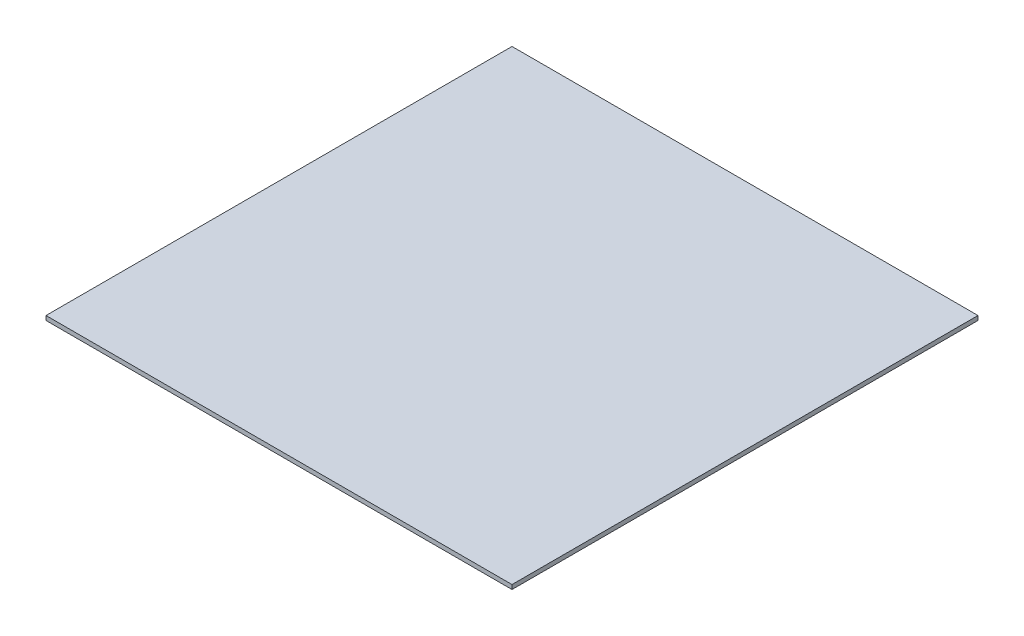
ISO-10303-21;
HEADER;
FILE_DESCRIPTION(('STEP AP214'),'2;1');
FILE_NAME('part.step','',(''),(''),'','','');
FILE_SCHEMA(('AUTOMOTIVE_DESIGN { 1 0 10303 214 1 1 1 1 }'));
ENDSEC;
DATA;
#1=APPLICATION_CONTEXT('core data for automotive mechanical design processes');
#2=APPLICATION_PROTOCOL_DEFINITION('international standard','automotive_design',2000,#1);
#3=PRODUCT_CONTEXT('',#1,'mechanical');
#4=PRODUCT('Part','Part','',(#3));
#5=PRODUCT_RELATED_PRODUCT_CATEGORY('part','',(#4));
#6=PRODUCT_DEFINITION_FORMATION('','',#4);
#7=PRODUCT_DEFINITION_CONTEXT('part definition',#1,'design');
#8=PRODUCT_DEFINITION('design','',#6,#7);
#9=PRODUCT_DEFINITION_SHAPE('','',#8);
#10=(LENGTH_UNIT() NAMED_UNIT(*) SI_UNIT(.MILLI.,.METRE.));
#11=(NAMED_UNIT(*) PLANE_ANGLE_UNIT() SI_UNIT($,.RADIAN.));
#12=(NAMED_UNIT(*) SI_UNIT($,.STERADIAN.) SOLID_ANGLE_UNIT());
#13=UNCERTAINTY_MEASURE_WITH_UNIT(LENGTH_MEASURE(1.E-05),#10,'distance_accuracy_value','');
#14=(GEOMETRIC_REPRESENTATION_CONTEXT(3) GLOBAL_UNCERTAINTY_ASSIGNED_CONTEXT((#13)) GLOBAL_UNIT_ASSIGNED_CONTEXT((#10,
#11,#12)) REPRESENTATION_CONTEXT('',''));
#15=CARTESIAN_POINT('',(0.,0.,0.));
#16=DIRECTION('',(0.,0.,1.));
#17=DIRECTION('',(1.,0.,0.));
#18=AXIS2_PLACEMENT_3D('',#15,#16,#17);
#19=CARTESIAN_POINT('',(215.,4.,-215.));
#20=DIRECTION('',(-1.,0.,0.));
#21=DIRECTION('',(0.,0.,1.));
#22=AXIS2_PLACEMENT_3D('',#19,#20,#21);
#23=PLANE('',#22);
#24=DIRECTION('',(0.,0.,-1.));
#25=VECTOR('',#24,1.);
#26=CARTESIAN_POINT('',(215.,0.,-215.));
#27=LINE('',#26,#25);
#28=CARTESIAN_POINT('',(215.,0.,215.));
#29=VERTEX_POINT('',#28);
#30=CARTESIAN_POINT('',(215.,0.,-215.));
#31=VERTEX_POINT('',#30);
#32=EDGE_CURVE('E96',#29,#31,#27,.T.);
#33=ORIENTED_EDGE('',*,*,#32,.T.);
#34=DIRECTION('',(0.,-1.,0.));
#35=VECTOR('',#34,1.);
#36=CARTESIAN_POINT('',(215.,4.,-215.));
#37=LINE('',#36,#35);
#38=CARTESIAN_POINT('',(215.,4.,-215.));
#39=VERTEX_POINT('',#38);
#40=EDGE_CURVE('E11',#39,#31,#37,.T.);
#41=ORIENTED_EDGE('',*,*,#40,.F.);
#42=DIRECTION('',(0.,0.,-1.));
#43=VECTOR('',#42,1.);
#44=CARTESIAN_POINT('',(215.,4.,-215.));
#45=LINE('',#44,#43);
#46=CARTESIAN_POINT('',(215.,4.,215.));
#47=VERTEX_POINT('',#46);
#48=EDGE_CURVE('E84',#47,#39,#45,.T.);
#49=ORIENTED_EDGE('',*,*,#48,.F.);
#50=DIRECTION('',(0.,-1.,0.));
#51=VECTOR('',#50,1.);
#52=CARTESIAN_POINT('',(215.,4.,215.));
#53=LINE('',#52,#51);
#54=EDGE_CURVE('E92',#47,#29,#53,.T.);
#55=ORIENTED_EDGE('',*,*,#54,.T.);
#56=EDGE_LOOP('',(#33,#41,#49,#55));
#57=FACE_BOUND('',#56,.T.);
#58=ADVANCED_FACE('F33',(#57),#23,.F.);
#59=CARTESIAN_POINT('',(-215.,4.,-215.));
#60=DIRECTION('',(0.,0.,1.));
#61=DIRECTION('',(1.,0.,0.));
#62=AXIS2_PLACEMENT_3D('',#59,#60,#61);
#63=PLANE('',#62);
#64=DIRECTION('',(-1.,0.,0.));
#65=VECTOR('',#64,1.);
#66=CARTESIAN_POINT('',(-215.,0.,-215.));
#67=LINE('',#66,#65);
#68=CARTESIAN_POINT('',(-215.,0.,-215.));
#69=VERTEX_POINT('',#68);
#70=EDGE_CURVE('E88',#31,#69,#67,.T.);
#71=ORIENTED_EDGE('',*,*,#70,.T.);
#72=DIRECTION('',(0.,-1.,0.));
#73=VECTOR('',#72,1.);
#74=CARTESIAN_POINT('',(-215.,4.,-215.));
#75=LINE('',#74,#73);
#76=CARTESIAN_POINT('',(-215.,4.,-215.));
#77=VERTEX_POINT('',#76);
#78=EDGE_CURVE('E41',#77,#69,#75,.T.);
#79=ORIENTED_EDGE('',*,*,#78,.F.);
#80=DIRECTION('',(-1.,0.,0.));
#81=VECTOR('',#80,1.);
#82=CARTESIAN_POINT('',(-215.,4.,-215.));
#83=LINE('',#82,#81);
#84=EDGE_CURVE('E79',#39,#77,#83,.T.);
#85=ORIENTED_EDGE('',*,*,#84,.F.);
#86=ORIENTED_EDGE('',*,*,#40,.T.);
#87=EDGE_LOOP('',(#71,#79,#85,#86));
#88=FACE_BOUND('',#87,.T.);
#89=ADVANCED_FACE('F87',(#88),#63,.F.);
#90=CARTESIAN_POINT('',(-215.,4.,-215.));
#91=DIRECTION('',(1.,0.,0.));
#92=DIRECTION('',(0.,0.,-1.));
#93=AXIS2_PLACEMENT_3D('',#90,#91,#92);
#94=PLANE('',#93);
#95=DIRECTION('',(0.,0.,1.));
#96=VECTOR('',#95,1.);
#97=CARTESIAN_POINT('',(-215.,0.,-215.));
#98=LINE('',#97,#96);
#99=CARTESIAN_POINT('',(-215.,0.,215.));
#100=VERTEX_POINT('',#99);
#101=EDGE_CURVE('E66',#69,#100,#98,.T.);
#102=ORIENTED_EDGE('',*,*,#101,.T.);
#103=DIRECTION('',(0.,-1.,0.));
#104=VECTOR('',#103,1.);
#105=CARTESIAN_POINT('',(-215.,4.,215.));
#106=LINE('',#105,#104);
#107=CARTESIAN_POINT('',(-215.,4.,215.));
#108=VERTEX_POINT('',#107);
#109=EDGE_CURVE('E89',#108,#100,#106,.T.);
#110=ORIENTED_EDGE('',*,*,#109,.F.);
#111=DIRECTION('',(0.,0.,1.));
#112=VECTOR('',#111,1.);
#113=CARTESIAN_POINT('',(-215.,4.,-215.));
#114=LINE('',#113,#112);
#115=EDGE_CURVE('E82',#77,#108,#114,.T.);
#116=ORIENTED_EDGE('',*,*,#115,.F.);
#117=ORIENTED_EDGE('',*,*,#78,.T.);
#118=EDGE_LOOP('',(#102,#110,#116,#117));
#119=FACE_BOUND('',#118,.T.);
#120=ADVANCED_FACE('F90',(#119),#94,.F.);
#121=CARTESIAN_POINT('',(-215.,4.,215.));
#122=DIRECTION('',(0.,0.,-1.));
#123=DIRECTION('',(-1.,0.,0.));
#124=AXIS2_PLACEMENT_3D('',#121,#122,#123);
#125=PLANE('',#124);
#126=DIRECTION('',(1.,0.,0.));
#127=VECTOR('',#126,1.);
#128=CARTESIAN_POINT('',(-215.,0.,215.));
#129=LINE('',#128,#127);
#130=EDGE_CURVE('E72',#100,#29,#129,.T.);
#131=ORIENTED_EDGE('',*,*,#130,.T.);
#132=ORIENTED_EDGE('',*,*,#54,.F.);
#133=DIRECTION('',(1.,0.,0.));
#134=VECTOR('',#133,1.);
#135=CARTESIAN_POINT('',(-215.,4.,215.));
#136=LINE('',#135,#134);
#137=EDGE_CURVE('E49',#108,#47,#136,.T.);
#138=ORIENTED_EDGE('',*,*,#137,.F.);
#139=ORIENTED_EDGE('',*,*,#109,.T.);
#140=EDGE_LOOP('',(#131,#132,#138,#139));
#141=FACE_BOUND('',#140,.T.);
#142=ADVANCED_FACE('F103',(#141),#125,.F.);
#143=CARTESIAN_POINT('',(0.,4.,0.));
#144=DIRECTION('',(0.,1.,0.));
#145=DIRECTION('',(0.,0.,1.));
#146=AXIS2_PLACEMENT_3D('',#143,#144,#145);
#147=PLANE('',#146);
#148=ORIENTED_EDGE('',*,*,#48,.T.);
#149=ORIENTED_EDGE('',*,*,#84,.T.);
#150=ORIENTED_EDGE('',*,*,#115,.T.);
#151=ORIENTED_EDGE('',*,*,#137,.T.);
#152=EDGE_LOOP('',(#148,#149,#150,#151));
#153=FACE_BOUND('',#152,.T.);
#154=ADVANCED_FACE('F80',(#153),#147,.T.);
#155=CARTESIAN_POINT('',(0.,0.,0.));
#156=DIRECTION('',(0.,1.,0.));
#157=DIRECTION('',(0.,0.,1.));
#158=AXIS2_PLACEMENT_3D('',#155,#156,#157);
#159=PLANE('',#158);
#160=ORIENTED_EDGE('',*,*,#32,.F.);
#161=ORIENTED_EDGE('',*,*,#130,.F.);
#162=ORIENTED_EDGE('',*,*,#101,.F.);
#163=ORIENTED_EDGE('',*,*,#70,.F.);
#164=EDGE_LOOP('',(#160,#161,#162,#163));
#165=FACE_BOUND('',#164,.T.);
#166=ADVANCED_FACE('F106',(#165),#159,.F.);
#167=CLOSED_SHELL('',(#58,#89,#120,#142,#154,#166));
#168=MANIFOLD_SOLID_BREP('B2',#167);
#169=ADVANCED_BREP_SHAPE_REPRESENTATION('',(#18,#168),#14);
#170=SHAPE_DEFINITION_REPRESENTATION(#9,#169);
ENDSEC;
END-ISO-10303-21;
